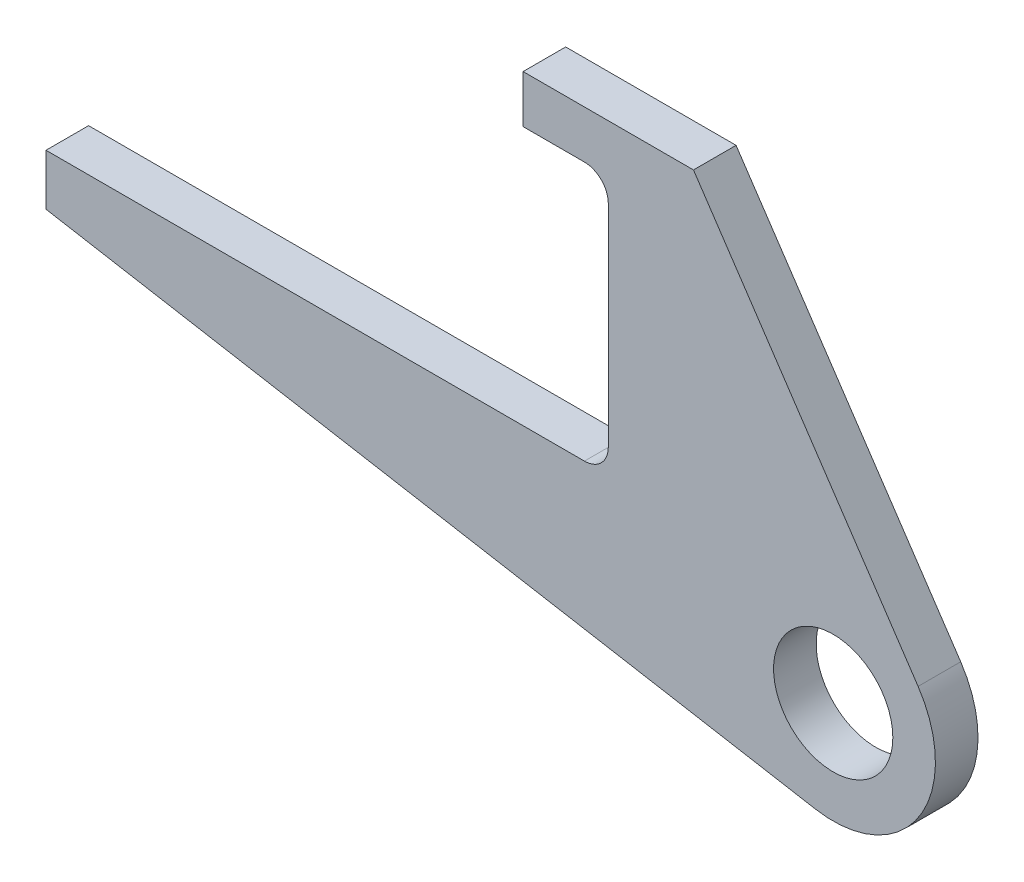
ISO-10303-21;
HEADER;
FILE_DESCRIPTION(('STEP AP214'),'2;1');
FILE_NAME('part.step','',(''),(''),'','','');
FILE_SCHEMA(('AUTOMOTIVE_DESIGN { 1 0 10303 214 1 1 1 1 }'));
ENDSEC;
DATA;
#1=APPLICATION_CONTEXT('core data for automotive mechanical design processes');
#2=APPLICATION_PROTOCOL_DEFINITION('international standard','automotive_design',2000,#1);
#3=PRODUCT_CONTEXT('',#1,'mechanical');
#4=PRODUCT('Part','Part','',(#3));
#5=PRODUCT_RELATED_PRODUCT_CATEGORY('part','',(#4));
#6=PRODUCT_DEFINITION_FORMATION('','',#4);
#7=PRODUCT_DEFINITION_CONTEXT('part definition',#1,'design');
#8=PRODUCT_DEFINITION('design','',#6,#7);
#9=PRODUCT_DEFINITION_SHAPE('','',#8);
#10=(LENGTH_UNIT() NAMED_UNIT(*) SI_UNIT(.MILLI.,.METRE.));
#11=(NAMED_UNIT(*) PLANE_ANGLE_UNIT() SI_UNIT($,.RADIAN.));
#12=(NAMED_UNIT(*) SI_UNIT($,.STERADIAN.) SOLID_ANGLE_UNIT());
#13=UNCERTAINTY_MEASURE_WITH_UNIT(LENGTH_MEASURE(1.E-05),#10,'distance_accuracy_value','');
#14=(GEOMETRIC_REPRESENTATION_CONTEXT(3) GLOBAL_UNCERTAINTY_ASSIGNED_CONTEXT((#13)) GLOBAL_UNIT_ASSIGNED_CONTEXT((#10,
#11,#12)) REPRESENTATION_CONTEXT('',''));
#15=CARTESIAN_POINT('',(0.,0.,0.));
#16=DIRECTION('',(0.,0.,1.));
#17=DIRECTION('',(1.,0.,0.));
#18=AXIS2_PLACEMENT_3D('',#15,#16,#17);
#19=CARTESIAN_POINT('',(0.,0.,25.));
#20=DIRECTION('',(0.,0.,-1.));
#21=DIRECTION('',(-1.,0.,0.));
#22=AXIS2_PLACEMENT_3D('',#19,#20,#21);
#23=PLANE('',#22);
#24=DIRECTION('',(0.,-1.,0.));
#25=VECTOR('',#24,1.);
#26=CARTESIAN_POINT('',(-462.,50.,25.));
#27=LINE('',#26,#25);
#28=CARTESIAN_POINT('',(-462.,50.,25.));
#29=VERTEX_POINT('',#28);
#30=CARTESIAN_POINT('',(-462.,20.,25.));
#31=VERTEX_POINT('',#30);
#32=EDGE_CURVE('E168',#29,#31,#27,.T.);
#33=ORIENTED_EDGE('',*,*,#32,.T.);
#34=DIRECTION('',(0.985007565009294,-0.172511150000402,0.));
#35=VECTOR('',#34,1.);
#36=CARTESIAN_POINT('',(-10.3506690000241,-59.1004539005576,25.));
#37=LINE('',#36,#35);
#38=CARTESIAN_POINT('',(-10.3506690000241,-59.1004539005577,25.));
#39=VERTEX_POINT('',#38);
#40=EDGE_CURVE('E101',#31,#39,#37,.T.);
#41=ORIENTED_EDGE('',*,*,#40,.T.);
#42=CARTESIAN_POINT('',(0.,0.,25.));
#43=DIRECTION('',(0.,0.,1.));
#44=DIRECTION('',(-1.,0.,0.));
#45=AXIS2_PLACEMENT_3D('',#42,#43,#44);
#46=CIRCLE('',#45,60.);
#47=CARTESIAN_POINT('',(49.8318756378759,33.4183208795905,25.));
#48=VERTEX_POINT('',#47);
#49=EDGE_CURVE('E192',#39,#48,#46,.T.);
#50=ORIENTED_EDGE('',*,*,#49,.T.);
#51=DIRECTION('',(-0.556972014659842,0.830531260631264,0.));
#52=VECTOR('',#51,1.);
#53=CARTESIAN_POINT('',(-82.,230.,25.));
#54=LINE('',#53,#52);
#55=CARTESIAN_POINT('',(-82.,230.,25.));
#56=VERTEX_POINT('',#55);
#57=EDGE_CURVE('E211',#48,#56,#54,.T.);
#58=ORIENTED_EDGE('',*,*,#57,.T.);
#59=DIRECTION('',(-1.,0.,0.));
#60=VECTOR('',#59,1.);
#61=CARTESIAN_POINT('',(-82.,230.,25.));
#62=LINE('',#61,#60);
#63=CARTESIAN_POINT('',(-182.,230.,25.));
#64=VERTEX_POINT('',#63);
#65=EDGE_CURVE('E208',#56,#64,#62,.T.);
#66=ORIENTED_EDGE('',*,*,#65,.T.);
#67=DIRECTION('',(0.,-1.,0.));
#68=VECTOR('',#67,1.);
#69=CARTESIAN_POINT('',(-182.,202.,25.));
#70=LINE('',#69,#68);
#71=CARTESIAN_POINT('',(-182.,202.,25.));
#72=VERTEX_POINT('',#71);
#73=EDGE_CURVE('E210',#64,#72,#70,.T.);
#74=ORIENTED_EDGE('',*,*,#73,.T.);
#75=DIRECTION('',(1.,0.,0.));
#76=VECTOR('',#75,1.);
#77=CARTESIAN_POINT('',(-182.,202.,25.));
#78=LINE('',#77,#76);
#79=CARTESIAN_POINT('',(-146.,202.,25.));
#80=VERTEX_POINT('',#79);
#81=EDGE_CURVE('E213',#72,#80,#78,.T.);
#82=ORIENTED_EDGE('',*,*,#81,.T.);
#83=CARTESIAN_POINT('',(-146.,188.,25.));
#84=DIRECTION('',(0.,0.,-1.));
#85=DIRECTION('',(-1.,0.,0.));
#86=AXIS2_PLACEMENT_3D('',#83,#84,#85);
#87=CIRCLE('',#86,14.);
#88=CARTESIAN_POINT('',(-132.,188.,25.));
#89=VERTEX_POINT('',#88);
#90=EDGE_CURVE('E129',#80,#89,#87,.T.);
#91=ORIENTED_EDGE('',*,*,#90,.T.);
#92=DIRECTION('',(0.,-1.,0.));
#93=VECTOR('',#92,1.);
#94=CARTESIAN_POINT('',(-132.,64.,25.));
#95=LINE('',#94,#93);
#96=CARTESIAN_POINT('',(-132.,64.,25.));
#97=VERTEX_POINT('',#96);
#98=EDGE_CURVE('E123',#89,#97,#95,.T.);
#99=ORIENTED_EDGE('',*,*,#98,.T.);
#100=CARTESIAN_POINT('',(-146.,64.,25.));
#101=DIRECTION('',(0.,0.,-1.));
#102=DIRECTION('',(1.,0.,0.));
#103=AXIS2_PLACEMENT_3D('',#100,#101,#102);
#104=CIRCLE('',#103,14.);
#105=CARTESIAN_POINT('',(-146.,50.,25.));
#106=VERTEX_POINT('',#105);
#107=EDGE_CURVE('E127',#97,#106,#104,.T.);
#108=ORIENTED_EDGE('',*,*,#107,.T.);
#109=DIRECTION('',(-1.,0.,0.));
#110=VECTOR('',#109,1.);
#111=CARTESIAN_POINT('',(-462.,50.,25.));
#112=LINE('',#111,#110);
#113=EDGE_CURVE('E49',#106,#29,#112,.T.);
#114=ORIENTED_EDGE('',*,*,#113,.T.);
#115=EDGE_LOOP('',(#33,#41,#50,#58,#66,#74,#82,#91,#99,#108,#114));
#116=FACE_BOUND('',#115,.T.);
#117=CARTESIAN_POINT('',(0.,0.,25.));
#118=DIRECTION('',(0.,0.,1.));
#119=DIRECTION('',(1.,0.,0.));
#120=AXIS2_PLACEMENT_3D('',#117,#118,#119);
#121=CIRCLE('',#120,35.);
#122=CARTESIAN_POINT('',(35.,0.,25.));
#123=VERTEX_POINT('',#122);
#124=EDGE_CURVE('E151',#123,#123,#121,.T.);
#125=ORIENTED_EDGE('',*,*,#124,.F.);
#126=EDGE_LOOP('',(#125));
#127=FACE_BOUND('',#126,.T.);
#128=ADVANCED_FACE('F32',(#116,#127),#23,.F.);
#129=CARTESIAN_POINT('',(0.,0.,0.));
#130=DIRECTION('',(0.,0.,-1.));
#131=DIRECTION('',(-1.,0.,0.));
#132=AXIS2_PLACEMENT_3D('',#129,#130,#131);
#133=PLANE('',#132);
#134=DIRECTION('',(0.,-1.,0.));
#135=VECTOR('',#134,1.);
#136=CARTESIAN_POINT('',(-462.,50.,0.));
#137=LINE('',#136,#135);
#138=CARTESIAN_POINT('',(-462.,50.,0.));
#139=VERTEX_POINT('',#138);
#140=CARTESIAN_POINT('',(-462.,20.,0.));
#141=VERTEX_POINT('',#140);
#142=EDGE_CURVE('E147',#139,#141,#137,.T.);
#143=ORIENTED_EDGE('',*,*,#142,.F.);
#144=DIRECTION('',(-1.,0.,0.));
#145=VECTOR('',#144,1.);
#146=CARTESIAN_POINT('',(-462.,50.,0.));
#147=LINE('',#146,#145);
#148=CARTESIAN_POINT('',(-146.,50.,0.));
#149=VERTEX_POINT('',#148);
#150=EDGE_CURVE('E93',#149,#139,#147,.T.);
#151=ORIENTED_EDGE('',*,*,#150,.F.);
#152=CARTESIAN_POINT('',(-146.,64.,0.));
#153=DIRECTION('',(0.,0.,-1.));
#154=DIRECTION('',(1.,0.,0.));
#155=AXIS2_PLACEMENT_3D('',#152,#153,#154);
#156=CIRCLE('',#155,14.);
#157=CARTESIAN_POINT('',(-132.,64.,0.));
#158=VERTEX_POINT('',#157);
#159=EDGE_CURVE('E87',#158,#149,#156,.T.);
#160=ORIENTED_EDGE('',*,*,#159,.F.);
#161=DIRECTION('',(0.,-1.,0.));
#162=VECTOR('',#161,1.);
#163=CARTESIAN_POINT('',(-132.,64.,0.));
#164=LINE('',#163,#162);
#165=CARTESIAN_POINT('',(-132.,188.,0.));
#166=VERTEX_POINT('',#165);
#167=EDGE_CURVE('E137',#166,#158,#164,.T.);
#168=ORIENTED_EDGE('',*,*,#167,.F.);
#169=CARTESIAN_POINT('',(-146.,188.,0.));
#170=DIRECTION('',(0.,0.,-1.));
#171=DIRECTION('',(-1.,0.,0.));
#172=AXIS2_PLACEMENT_3D('',#169,#170,#171);
#173=CIRCLE('',#172,14.);
#174=CARTESIAN_POINT('',(-146.,202.,0.));
#175=VERTEX_POINT('',#174);
#176=EDGE_CURVE('E163',#175,#166,#173,.T.);
#177=ORIENTED_EDGE('',*,*,#176,.F.);
#178=DIRECTION('',(1.,0.,0.));
#179=VECTOR('',#178,1.);
#180=CARTESIAN_POINT('',(-182.,202.,0.));
#181=LINE('',#180,#179);
#182=CARTESIAN_POINT('',(-182.,202.,0.));
#183=VERTEX_POINT('',#182);
#184=EDGE_CURVE('E161',#183,#175,#181,.T.);
#185=ORIENTED_EDGE('',*,*,#184,.F.);
#186=DIRECTION('',(0.,-1.,0.));
#187=VECTOR('',#186,1.);
#188=CARTESIAN_POINT('',(-182.,202.,0.));
#189=LINE('',#188,#187);
#190=CARTESIAN_POINT('',(-182.,230.,0.));
#191=VERTEX_POINT('',#190);
#192=EDGE_CURVE('E159',#191,#183,#189,.T.);
#193=ORIENTED_EDGE('',*,*,#192,.F.);
#194=DIRECTION('',(-1.,0.,0.));
#195=VECTOR('',#194,1.);
#196=CARTESIAN_POINT('',(-82.,230.,0.));
#197=LINE('',#196,#195);
#198=CARTESIAN_POINT('',(-82.,230.,0.));
#199=VERTEX_POINT('',#198);
#200=EDGE_CURVE('E157',#199,#191,#197,.T.);
#201=ORIENTED_EDGE('',*,*,#200,.F.);
#202=DIRECTION('',(-0.556972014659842,0.830531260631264,0.));
#203=VECTOR('',#202,1.);
#204=CARTESIAN_POINT('',(-82.,230.,0.));
#205=LINE('',#204,#203);
#206=CARTESIAN_POINT('',(49.8318756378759,33.4183208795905,0.));
#207=VERTEX_POINT('',#206);
#208=EDGE_CURVE('E155',#207,#199,#205,.T.);
#209=ORIENTED_EDGE('',*,*,#208,.F.);
#210=CARTESIAN_POINT('',(0.,0.,0.));
#211=DIRECTION('',(0.,0.,1.));
#212=DIRECTION('',(-1.,0.,0.));
#213=AXIS2_PLACEMENT_3D('',#210,#211,#212);
#214=CIRCLE('',#213,60.);
#215=CARTESIAN_POINT('',(-10.3506690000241,-59.1004539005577,0.));
#216=VERTEX_POINT('',#215);
#217=EDGE_CURVE('E153',#216,#207,#214,.T.);
#218=ORIENTED_EDGE('',*,*,#217,.F.);
#219=DIRECTION('',(0.985007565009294,-0.172511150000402,0.));
#220=VECTOR('',#219,1.);
#221=CARTESIAN_POINT('',(-10.3506690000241,-59.1004539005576,0.));
#222=LINE('',#221,#220);
#223=EDGE_CURVE('E150',#141,#216,#222,.T.);
#224=ORIENTED_EDGE('',*,*,#223,.F.);
#225=EDGE_LOOP('',(#143,#151,#160,#168,#177,#185,#193,#201,#209,#218,#224));
#226=FACE_BOUND('',#225,.T.);
#227=CARTESIAN_POINT('',(0.,0.,0.));
#228=DIRECTION('',(0.,0.,1.));
#229=DIRECTION('',(1.,0.,0.));
#230=AXIS2_PLACEMENT_3D('',#227,#228,#229);
#231=CIRCLE('',#230,35.);
#232=CARTESIAN_POINT('',(35.,0.,0.));
#233=VERTEX_POINT('',#232);
#234=EDGE_CURVE('E351',#233,#233,#231,.T.);
#235=ORIENTED_EDGE('',*,*,#234,.T.);
#236=EDGE_LOOP('',(#235));
#237=FACE_BOUND('',#236,.T.);
#238=ADVANCED_FACE('F196',(#226,#237),#133,.T.);
#239=CARTESIAN_POINT('',(-462.,50.,25.));
#240=DIRECTION('',(1.,0.,0.));
#241=DIRECTION('',(0.,0.,-1.));
#242=AXIS2_PLACEMENT_3D('',#239,#240,#241);
#243=PLANE('',#242);
#244=ORIENTED_EDGE('',*,*,#142,.T.);
#245=DIRECTION('',(0.,0.,-1.));
#246=VECTOR('',#245,1.);
#247=CARTESIAN_POINT('',(-462.,20.,25.));
#248=LINE('',#247,#246);
#249=EDGE_CURVE('E11',#31,#141,#248,.T.);
#250=ORIENTED_EDGE('',*,*,#249,.F.);
#251=ORIENTED_EDGE('',*,*,#32,.F.);
#252=DIRECTION('',(0.,0.,-1.));
#253=VECTOR('',#252,1.);
#254=CARTESIAN_POINT('',(-462.,50.,25.));
#255=LINE('',#254,#253);
#256=EDGE_CURVE('E143',#29,#139,#255,.T.);
#257=ORIENTED_EDGE('',*,*,#256,.T.);
#258=EDGE_LOOP('',(#244,#250,#251,#257));
#259=FACE_BOUND('',#258,.T.);
#260=ADVANCED_FACE('F34',(#259),#243,.F.);
#261=CARTESIAN_POINT('',(-10.3506690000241,-59.1004539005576,25.));
#262=DIRECTION('',(0.172511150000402,0.985007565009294,0.));
#263=DIRECTION('',(-0.985007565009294,0.172511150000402,0.));
#264=AXIS2_PLACEMENT_3D('',#261,#262,#263);
#265=PLANE('',#264);
#266=ORIENTED_EDGE('',*,*,#223,.T.);
#267=DIRECTION('',(0.,0.,-1.));
#268=VECTOR('',#267,1.);
#269=CARTESIAN_POINT('',(-10.3506690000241,-59.1004539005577,25.));
#270=LINE('',#269,#268);
#271=EDGE_CURVE('E41',#39,#216,#270,.T.);
#272=ORIENTED_EDGE('',*,*,#271,.F.);
#273=ORIENTED_EDGE('',*,*,#40,.F.);
#274=ORIENTED_EDGE('',*,*,#249,.T.);
#275=EDGE_LOOP('',(#266,#272,#273,#274));
#276=FACE_BOUND('',#275,.T.);
#277=ADVANCED_FACE('F250',(#276),#265,.F.);
#278=CARTESIAN_POINT('',(0.,0.,25.));
#279=DIRECTION('',(0.,0.,-1.));
#280=DIRECTION('',(-1.,0.,0.));
#281=AXIS2_PLACEMENT_3D('',#278,#279,#280);
#282=CYLINDRICAL_SURFACE('',#281,60.);
#283=ORIENTED_EDGE('',*,*,#217,.T.);
#284=DIRECTION('',(0.,0.,-1.));
#285=VECTOR('',#284,1.);
#286=CARTESIAN_POINT('',(49.8318756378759,33.4183208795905,25.));
#287=LINE('',#286,#285);
#288=EDGE_CURVE('E184',#48,#207,#287,.T.);
#289=ORIENTED_EDGE('',*,*,#288,.F.);
#290=ORIENTED_EDGE('',*,*,#49,.F.);
#291=ORIENTED_EDGE('',*,*,#271,.T.);
#292=EDGE_LOOP('',(#283,#289,#290,#291));
#293=FACE_BOUND('',#292,.T.);
#294=ADVANCED_FACE('F190',(#293),#282,.T.);
#295=CARTESIAN_POINT('',(-82.,230.,25.));
#296=DIRECTION('',(-0.830531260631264,-0.556972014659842,0.));
#297=DIRECTION('',(0.556972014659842,-0.830531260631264,0.));
#298=AXIS2_PLACEMENT_3D('',#295,#296,#297);
#299=PLANE('',#298);
#300=ORIENTED_EDGE('',*,*,#208,.T.);
#301=DIRECTION('',(0.,0.,-1.));
#302=VECTOR('',#301,1.);
#303=CARTESIAN_POINT('',(-82.,230.,25.));
#304=LINE('',#303,#302);
#305=EDGE_CURVE('E181',#56,#199,#304,.T.);
#306=ORIENTED_EDGE('',*,*,#305,.F.);
#307=ORIENTED_EDGE('',*,*,#57,.F.);
#308=ORIENTED_EDGE('',*,*,#288,.T.);
#309=EDGE_LOOP('',(#300,#306,#307,#308));
#310=FACE_BOUND('',#309,.T.);
#311=ADVANCED_FACE('F202',(#310),#299,.F.);
#312=CARTESIAN_POINT('',(-82.,230.,25.));
#313=DIRECTION('',(0.,-1.,0.));
#314=DIRECTION('',(1.,0.,0.));
#315=AXIS2_PLACEMENT_3D('',#312,#313,#314);
#316=PLANE('',#315);
#317=ORIENTED_EDGE('',*,*,#200,.T.);
#318=DIRECTION('',(0.,0.,-1.));
#319=VECTOR('',#318,1.);
#320=CARTESIAN_POINT('',(-182.,230.,25.));
#321=LINE('',#320,#319);
#322=EDGE_CURVE('E178',#64,#191,#321,.T.);
#323=ORIENTED_EDGE('',*,*,#322,.F.);
#324=ORIENTED_EDGE('',*,*,#65,.F.);
#325=ORIENTED_EDGE('',*,*,#305,.T.);
#326=EDGE_LOOP('',(#317,#323,#324,#325));
#327=FACE_BOUND('',#326,.T.);
#328=ADVANCED_FACE('F206',(#327),#316,.F.);
#329=CARTESIAN_POINT('',(-182.,202.,25.));
#330=DIRECTION('',(1.,0.,0.));
#331=DIRECTION('',(0.,1.,0.));
#332=AXIS2_PLACEMENT_3D('',#329,#330,#331);
#333=PLANE('',#332);
#334=ORIENTED_EDGE('',*,*,#192,.T.);
#335=DIRECTION('',(0.,0.,-1.));
#336=VECTOR('',#335,1.);
#337=CARTESIAN_POINT('',(-182.,202.,25.));
#338=LINE('',#337,#336);
#339=EDGE_CURVE('E175',#72,#183,#338,.T.);
#340=ORIENTED_EDGE('',*,*,#339,.F.);
#341=ORIENTED_EDGE('',*,*,#73,.F.);
#342=ORIENTED_EDGE('',*,*,#322,.T.);
#343=EDGE_LOOP('',(#334,#340,#341,#342));
#344=FACE_BOUND('',#343,.T.);
#345=ADVANCED_FACE('F263',(#344),#333,.F.);
#346=CARTESIAN_POINT('',(-182.,202.,25.));
#347=DIRECTION('',(0.,1.,0.));
#348=DIRECTION('',(0.,0.,1.));
#349=AXIS2_PLACEMENT_3D('',#346,#347,#348);
#350=PLANE('',#349);
#351=ORIENTED_EDGE('',*,*,#184,.T.);
#352=DIRECTION('',(0.,0.,-1.));
#353=VECTOR('',#352,1.);
#354=CARTESIAN_POINT('',(-146.,202.,25.));
#355=LINE('',#354,#353);
#356=EDGE_CURVE('E172',#80,#175,#355,.T.);
#357=ORIENTED_EDGE('',*,*,#356,.F.);
#358=ORIENTED_EDGE('',*,*,#81,.F.);
#359=ORIENTED_EDGE('',*,*,#339,.T.);
#360=EDGE_LOOP('',(#351,#357,#358,#359));
#361=FACE_BOUND('',#360,.T.);
#362=ADVANCED_FACE('F222',(#361),#350,.F.);
#363=CARTESIAN_POINT('',(-146.,188.,25.));
#364=DIRECTION('',(0.,0.,-1.));
#365=DIRECTION('',(-1.,0.,0.));
#366=AXIS2_PLACEMENT_3D('',#363,#364,#365);
#367=CYLINDRICAL_SURFACE('',#366,14.);
#368=ORIENTED_EDGE('',*,*,#176,.T.);
#369=DIRECTION('',(0.,0.,-1.));
#370=VECTOR('',#369,1.);
#371=CARTESIAN_POINT('',(-132.,188.,25.));
#372=LINE('',#371,#370);
#373=EDGE_CURVE('E138',#89,#166,#372,.T.);
#374=ORIENTED_EDGE('',*,*,#373,.F.);
#375=ORIENTED_EDGE('',*,*,#90,.F.);
#376=ORIENTED_EDGE('',*,*,#356,.T.);
#377=EDGE_LOOP('',(#368,#374,#375,#376));
#378=FACE_BOUND('',#377,.T.);
#379=ADVANCED_FACE('F226',(#378),#367,.F.);
#380=CARTESIAN_POINT('',(-132.,64.,25.));
#381=DIRECTION('',(1.,0.,0.));
#382=DIRECTION('',(0.,0.,-1.));
#383=AXIS2_PLACEMENT_3D('',#380,#381,#382);
#384=PLANE('',#383);
#385=ORIENTED_EDGE('',*,*,#167,.T.);
#386=DIRECTION('',(0.,0.,-1.));
#387=VECTOR('',#386,1.);
#388=CARTESIAN_POINT('',(-132.,64.,25.));
#389=LINE('',#388,#387);
#390=EDGE_CURVE('E134',#97,#158,#389,.T.);
#391=ORIENTED_EDGE('',*,*,#390,.F.);
#392=ORIENTED_EDGE('',*,*,#98,.F.);
#393=ORIENTED_EDGE('',*,*,#373,.T.);
#394=EDGE_LOOP('',(#385,#391,#392,#393));
#395=FACE_BOUND('',#394,.T.);
#396=ADVANCED_FACE('F135',(#395),#384,.F.);
#397=CARTESIAN_POINT('',(-146.,64.,25.));
#398=DIRECTION('',(0.,0.,-1.));
#399=DIRECTION('',(-1.,0.,0.));
#400=AXIS2_PLACEMENT_3D('',#397,#398,#399);
#401=CYLINDRICAL_SURFACE('',#400,14.);
#402=ORIENTED_EDGE('',*,*,#159,.T.);
#403=DIRECTION('',(0.,0.,-1.));
#404=VECTOR('',#403,1.);
#405=CARTESIAN_POINT('',(-146.,50.,25.));
#406=LINE('',#405,#404);
#407=EDGE_CURVE('E139',#106,#149,#406,.T.);
#408=ORIENTED_EDGE('',*,*,#407,.F.);
#409=ORIENTED_EDGE('',*,*,#107,.F.);
#410=ORIENTED_EDGE('',*,*,#390,.T.);
#411=EDGE_LOOP('',(#402,#408,#409,#410));
#412=FACE_BOUND('',#411,.T.);
#413=ADVANCED_FACE('F141',(#412),#401,.F.);
#414=CARTESIAN_POINT('',(-462.,50.,25.));
#415=DIRECTION('',(0.,-1.,0.));
#416=DIRECTION('',(0.,0.,-1.));
#417=AXIS2_PLACEMENT_3D('',#414,#415,#416);
#418=PLANE('',#417);
#419=ORIENTED_EDGE('',*,*,#150,.T.);
#420=ORIENTED_EDGE('',*,*,#256,.F.);
#421=ORIENTED_EDGE('',*,*,#113,.F.);
#422=ORIENTED_EDGE('',*,*,#407,.T.);
#423=EDGE_LOOP('',(#419,#420,#421,#422));
#424=FACE_BOUND('',#423,.T.);
#425=ADVANCED_FACE('F230',(#424),#418,.F.);
#426=CARTESIAN_POINT('',(0.,0.,25.));
#427=DIRECTION('',(0.,0.,-1.));
#428=DIRECTION('',(-1.,0.,0.));
#429=AXIS2_PLACEMENT_3D('',#426,#427,#428);
#430=CYLINDRICAL_SURFACE('',#429,35.);
#431=ORIENTED_EDGE('',*,*,#124,.T.);
#432=EDGE_LOOP('',(#431));
#433=FACE_BOUND('',#432,.T.);
#434=ORIENTED_EDGE('',*,*,#234,.F.);
#435=EDGE_LOOP('',(#434));
#436=FACE_BOUND('',#435,.T.);
#437=ADVANCED_FACE('F232',(#433,#436),#430,.F.);
#438=CLOSED_SHELL('',(#128,#238,#260,#277,#294,#311,#328,#345,#362,#379,#396,#413,#425,#437));
#439=MANIFOLD_SOLID_BREP('B2',#438);
#440=ADVANCED_BREP_SHAPE_REPRESENTATION('',(#18,#439),#14);
#441=SHAPE_DEFINITION_REPRESENTATION(#9,#440);
ENDSEC;
END-ISO-10303-21;
